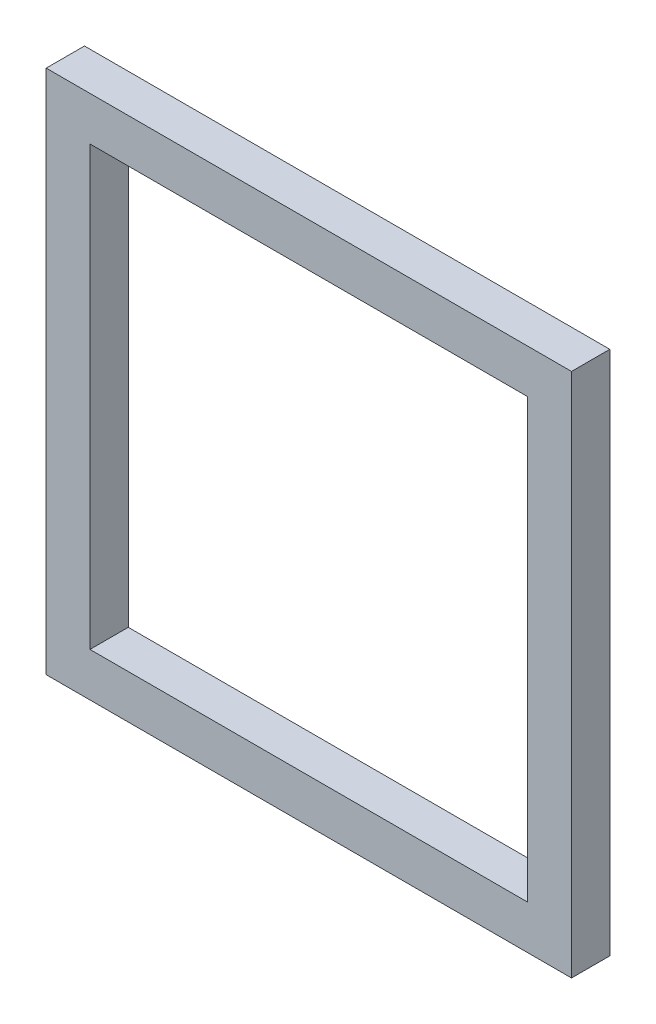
from build123d import *

# Parameters (mm, degrees)
SKIZZE2_W = 40
SKIZZE2_H = 35


with BuildPart() as part:
    # Austragung1: sweep along a path in Skizze1
    with BuildLine(Plane.XY) as austragung1_path:
        Line((300, 1400), (700, 1400))
        Line((700, 1400), (700, 1000))
        Line((700, 1000), (300, 1000))
        Line((300, 1000), (300, 1400))
    # Skizze2 → Austragung1 (sweep)
    with BuildSketch(Plane(origin=(300, 1000, 0), x_dir=(1, 0, 0), z_dir=(0, -1, 0))):
        with Locations((-20, 17.5)):
            Rectangle(SKIZZE2_W, SKIZZE2_H)
    sweep(path=austragung1_path.line, transition=Transition.RIGHT)


solid = part.part
